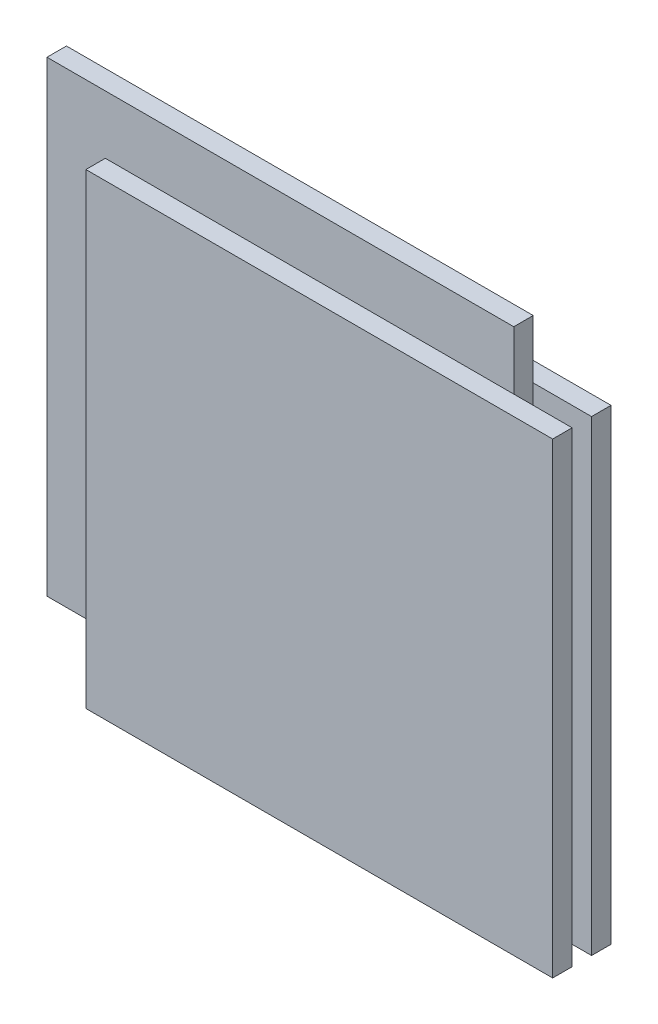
ISO-10303-21;
HEADER;
FILE_DESCRIPTION(('STEP AP214'),'2;1');
FILE_NAME('part.step','',(''),(''),'','','');
FILE_SCHEMA(('AUTOMOTIVE_DESIGN { 1 0 10303 214 1 1 1 1 }'));
ENDSEC;
DATA;
#1=APPLICATION_CONTEXT('core data for automotive mechanical design processes');
#2=APPLICATION_PROTOCOL_DEFINITION('international standard','automotive_design',2000,#1);
#3=PRODUCT_CONTEXT('',#1,'mechanical');
#4=PRODUCT('Part','Part','',(#3));
#5=PRODUCT_RELATED_PRODUCT_CATEGORY('part','',(#4));
#6=PRODUCT_DEFINITION_FORMATION('','',#4);
#7=PRODUCT_DEFINITION_CONTEXT('part definition',#1,'design');
#8=PRODUCT_DEFINITION('design','',#6,#7);
#9=PRODUCT_DEFINITION_SHAPE('','',#8);
#10=(LENGTH_UNIT() NAMED_UNIT(*) SI_UNIT(.MILLI.,.METRE.));
#11=(NAMED_UNIT(*) PLANE_ANGLE_UNIT() SI_UNIT($,.RADIAN.));
#12=(NAMED_UNIT(*) SI_UNIT($,.STERADIAN.) SOLID_ANGLE_UNIT());
#13=UNCERTAINTY_MEASURE_WITH_UNIT(LENGTH_MEASURE(1.E-05),#10,'distance_accuracy_value','');
#14=(GEOMETRIC_REPRESENTATION_CONTEXT(3) GLOBAL_UNCERTAINTY_ASSIGNED_CONTEXT((#13)) GLOBAL_UNIT_ASSIGNED_CONTEXT((#10,
#11,#12)) REPRESENTATION_CONTEXT('',''));
#15=CARTESIAN_POINT('',(0.,0.,0.));
#16=DIRECTION('',(0.,0.,1.));
#17=DIRECTION('',(1.,0.,0.));
#18=AXIS2_PLACEMENT_3D('',#15,#16,#17);
#19=CARTESIAN_POINT('',(0.,0.,-2.5));
#20=DIRECTION('',(0.,0.,1.));
#21=DIRECTION('',(1.,0.,0.));
#22=AXIS2_PLACEMENT_3D('',#19,#20,#21);
#23=PLANE('',#22);
#24=DIRECTION('',(1.,0.,0.));
#25=VECTOR('',#24,1.);
#26=CARTESIAN_POINT('',(75.,45.,-2.5));
#27=LINE('',#26,#25);
#28=CARTESIAN_POINT('',(-45.,45.,-2.5));
#29=VERTEX_POINT('',#28);
#30=CARTESIAN_POINT('',(60.,45.,-2.5));
#31=VERTEX_POINT('',#30);
#32=EDGE_CURVE('E467',#29,#31,#27,.T.);
#33=ORIENTED_EDGE('',*,*,#32,.F.);
#34=DIRECTION('',(0.,1.,0.));
#35=VECTOR('',#34,1.);
#36=CARTESIAN_POINT('',(-45.,45.,-2.5));
#37=LINE('',#36,#35);
#38=CARTESIAN_POINT('',(-45.,-60.,-2.5));
#39=VERTEX_POINT('',#38);
#40=EDGE_CURVE('E11',#39,#29,#37,.T.);
#41=ORIENTED_EDGE('',*,*,#40,.F.);
#42=DIRECTION('',(1.,0.,0.));
#43=VECTOR('',#42,1.);
#44=CARTESIAN_POINT('',(-60.,-60.,-2.5));
#45=LINE('',#44,#43);
#46=CARTESIAN_POINT('',(-60.,-60.,-2.5));
#47=VERTEX_POINT('',#46);
#48=EDGE_CURVE('E249',#47,#39,#45,.T.);
#49=ORIENTED_EDGE('',*,*,#48,.F.);
#50=DIRECTION('',(0.,-1.,0.));
#51=VECTOR('',#50,1.);
#52=CARTESIAN_POINT('',(-60.,60.,-2.5));
#53=LINE('',#52,#51);
#54=CARTESIAN_POINT('',(-60.,60.,-2.5));
#55=VERTEX_POINT('',#54);
#56=EDGE_CURVE('E245',#55,#47,#53,.T.);
#57=ORIENTED_EDGE('',*,*,#56,.F.);
#58=DIRECTION('',(-1.,0.,0.));
#59=VECTOR('',#58,1.);
#60=CARTESIAN_POINT('',(-60.,60.,-2.5));
#61=LINE('',#60,#59);
#62=CARTESIAN_POINT('',(60.,60.,-2.5));
#63=VERTEX_POINT('',#62);
#64=EDGE_CURVE('E242',#63,#55,#61,.T.);
#65=ORIENTED_EDGE('',*,*,#64,.F.);
#66=DIRECTION('',(0.,1.,0.));
#67=VECTOR('',#66,1.);
#68=CARTESIAN_POINT('',(60.,60.,-2.5));
#69=LINE('',#68,#67);
#70=EDGE_CURVE('E62',#31,#63,#69,.T.);
#71=ORIENTED_EDGE('',*,*,#70,.F.);
#72=EDGE_LOOP('',(#33,#41,#49,#57,#65,#71));
#73=FACE_BOUND('',#72,.T.);
#74=ADVANCED_FACE('F39',(#73),#23,.F.);
#75=CARTESIAN_POINT('',(60.,60.,2.5));
#76=DIRECTION('',(-1.,0.,0.));
#77=DIRECTION('',(0.,-1.,0.));
#78=AXIS2_PLACEMENT_3D('',#75,#76,#77);
#79=PLANE('',#78);
#80=CARTESIAN_POINT('',(60.,-60.,-2.5));
#81=VERTEX_POINT('',#80);
#82=EDGE_CURVE('E239',#81,#31,#69,.T.);
#83=ORIENTED_EDGE('',*,*,#82,.T.);
#84=ORIENTED_EDGE('',*,*,#70,.T.);
#85=DIRECTION('',(0.,0.,-1.));
#86=VECTOR('',#85,1.);
#87=CARTESIAN_POINT('',(60.,60.,2.5));
#88=LINE('',#87,#86);
#89=CARTESIAN_POINT('',(60.,60.,2.5));
#90=VERTEX_POINT('',#89);
#91=EDGE_CURVE('E43',#90,#63,#88,.T.);
#92=ORIENTED_EDGE('',*,*,#91,.F.);
#93=DIRECTION('',(0.,1.,0.));
#94=VECTOR('',#93,1.);
#95=CARTESIAN_POINT('',(60.,60.,2.5));
#96=LINE('',#95,#94);
#97=CARTESIAN_POINT('',(60.,45.,2.5));
#98=VERTEX_POINT('',#97);
#99=EDGE_CURVE('E227',#98,#90,#96,.T.);
#100=ORIENTED_EDGE('',*,*,#99,.F.);
#101=CARTESIAN_POINT('',(60.,-60.,2.5));
#102=VERTEX_POINT('',#101);
#103=EDGE_CURVE('E222',#102,#98,#96,.T.);
#104=ORIENTED_EDGE('',*,*,#103,.F.);
#105=DIRECTION('',(0.,0.,-1.));
#106=VECTOR('',#105,1.);
#107=CARTESIAN_POINT('',(60.,-60.,2.5));
#108=LINE('',#107,#106);
#109=EDGE_CURVE('E238',#102,#81,#108,.T.);
#110=ORIENTED_EDGE('',*,*,#109,.T.);
#111=EDGE_LOOP('',(#83,#84,#92,#100,#104,#110));
#112=FACE_BOUND('',#111,.T.);
#113=ADVANCED_FACE('F41',(#112),#79,.F.);
#114=CARTESIAN_POINT('',(-60.,60.,2.5));
#115=DIRECTION('',(0.,-1.,0.));
#116=DIRECTION('',(0.,0.,-1.));
#117=AXIS2_PLACEMENT_3D('',#114,#115,#116);
#118=PLANE('',#117);
#119=ORIENTED_EDGE('',*,*,#64,.T.);
#120=DIRECTION('',(0.,0.,-1.));
#121=VECTOR('',#120,1.);
#122=CARTESIAN_POINT('',(-60.,60.,2.5));
#123=LINE('',#122,#121);
#124=CARTESIAN_POINT('',(-60.,60.,2.5));
#125=VERTEX_POINT('',#124);
#126=EDGE_CURVE('E258',#125,#55,#123,.T.);
#127=ORIENTED_EDGE('',*,*,#126,.F.);
#128=DIRECTION('',(-1.,0.,0.));
#129=VECTOR('',#128,1.);
#130=CARTESIAN_POINT('',(-60.,60.,2.5));
#131=LINE('',#130,#129);
#132=EDGE_CURVE('E226',#90,#125,#131,.T.);
#133=ORIENTED_EDGE('',*,*,#132,.F.);
#134=ORIENTED_EDGE('',*,*,#91,.T.);
#135=EDGE_LOOP('',(#119,#127,#133,#134));
#136=FACE_BOUND('',#135,.T.);
#137=ADVANCED_FACE('F319',(#136),#118,.F.);
#138=CARTESIAN_POINT('',(-60.,60.,2.5));
#139=DIRECTION('',(1.,0.,0.));
#140=DIRECTION('',(0.,1.,0.));
#141=AXIS2_PLACEMENT_3D('',#138,#139,#140);
#142=PLANE('',#141);
#143=ORIENTED_EDGE('',*,*,#56,.T.);
#144=DIRECTION('',(0.,0.,-1.));
#145=VECTOR('',#144,1.);
#146=CARTESIAN_POINT('',(-60.,-60.,2.5));
#147=LINE('',#146,#145);
#148=CARTESIAN_POINT('',(-60.,-60.,2.5));
#149=VERTEX_POINT('',#148);
#150=EDGE_CURVE('E255',#149,#47,#147,.T.);
#151=ORIENTED_EDGE('',*,*,#150,.F.);
#152=DIRECTION('',(0.,-1.,0.));
#153=VECTOR('',#152,1.);
#154=CARTESIAN_POINT('',(-60.,60.,2.5));
#155=LINE('',#154,#153);
#156=EDGE_CURVE('E230',#125,#149,#155,.T.);
#157=ORIENTED_EDGE('',*,*,#156,.F.);
#158=ORIENTED_EDGE('',*,*,#126,.T.);
#159=EDGE_LOOP('',(#143,#151,#157,#158));
#160=FACE_BOUND('',#159,.T.);
#161=ADVANCED_FACE('F327',(#160),#142,.F.);
#162=CARTESIAN_POINT('',(-60.,-60.,2.5));
#163=DIRECTION('',(0.,1.,0.));
#164=DIRECTION('',(0.,0.,1.));
#165=AXIS2_PLACEMENT_3D('',#162,#163,#164);
#166=PLANE('',#165);
#167=ORIENTED_EDGE('',*,*,#48,.T.);
#168=EDGE_CURVE('E248',#39,#81,#45,.T.);
#169=ORIENTED_EDGE('',*,*,#168,.T.);
#170=ORIENTED_EDGE('',*,*,#109,.F.);
#171=DIRECTION('',(1.,0.,0.));
#172=VECTOR('',#171,1.);
#173=CARTESIAN_POINT('',(-60.,-60.,2.5));
#174=LINE('',#173,#172);
#175=CARTESIAN_POINT('',(-45.,-60.,2.5));
#176=VERTEX_POINT('',#175);
#177=EDGE_CURVE('E233',#176,#102,#174,.T.);
#178=ORIENTED_EDGE('',*,*,#177,.F.);
#179=EDGE_CURVE('E234',#149,#176,#174,.T.);
#180=ORIENTED_EDGE('',*,*,#179,.F.);
#181=ORIENTED_EDGE('',*,*,#150,.T.);
#182=EDGE_LOOP('',(#167,#169,#170,#178,#180,#181));
#183=FACE_BOUND('',#182,.T.);
#184=ADVANCED_FACE('F324',(#183),#166,.F.);
#185=CARTESIAN_POINT('',(0.,0.,2.5));
#186=DIRECTION('',(0.,0.,1.));
#187=DIRECTION('',(1.,0.,0.));
#188=AXIS2_PLACEMENT_3D('',#185,#186,#187);
#189=PLANE('',#188);
#190=DIRECTION('',(0.,-1.,0.));
#191=VECTOR('',#190,1.);
#192=CARTESIAN_POINT('',(-45.,45.,2.5));
#193=LINE('',#192,#191);
#194=CARTESIAN_POINT('',(-45.,45.,2.5));
#195=VERTEX_POINT('',#194);
#196=EDGE_CURVE('E201',#195,#176,#193,.T.);
#197=ORIENTED_EDGE('',*,*,#196,.F.);
#198=DIRECTION('',(-1.,0.,0.));
#199=VECTOR('',#198,1.);
#200=CARTESIAN_POINT('',(75.,45.,2.5));
#201=LINE('',#200,#199);
#202=EDGE_CURVE('E49',#98,#195,#201,.T.);
#203=ORIENTED_EDGE('',*,*,#202,.F.);
#204=ORIENTED_EDGE('',*,*,#99,.T.);
#205=ORIENTED_EDGE('',*,*,#132,.T.);
#206=ORIENTED_EDGE('',*,*,#156,.T.);
#207=ORIENTED_EDGE('',*,*,#179,.T.);
#208=EDGE_LOOP('',(#197,#203,#204,#205,#206,#207));
#209=FACE_BOUND('',#208,.T.);
#210=ADVANCED_FACE('F322',(#209),#189,.T.);
#211=CARTESIAN_POINT('',(0.,0.,2.5));
#212=DIRECTION('',(0.,0.,1.));
#213=DIRECTION('',(1.,0.,0.));
#214=AXIS2_PLACEMENT_3D('',#211,#212,#213);
#215=PLANE('',#214);
#216=ORIENTED_EDGE('',*,*,#177,.T.);
#217=ORIENTED_EDGE('',*,*,#103,.T.);
#218=CARTESIAN_POINT('',(75.,45.,2.5));
#219=VERTEX_POINT('',#218);
#220=EDGE_CURVE('E176',#219,#98,#201,.T.);
#221=ORIENTED_EDGE('',*,*,#220,.F.);
#222=DIRECTION('',(0.,1.,0.));
#223=VECTOR('',#222,1.);
#224=CARTESIAN_POINT('',(75.,-75.,2.5));
#225=LINE('',#224,#223);
#226=CARTESIAN_POINT('',(75.,-75.,2.5));
#227=VERTEX_POINT('',#226);
#228=EDGE_CURVE('E171',#227,#219,#225,.T.);
#229=ORIENTED_EDGE('',*,*,#228,.F.);
#230=DIRECTION('',(1.,0.,0.));
#231=VECTOR('',#230,1.);
#232=CARTESIAN_POINT('',(-45.,-75.,2.5));
#233=LINE('',#232,#231);
#234=CARTESIAN_POINT('',(-45.,-75.,2.5));
#235=VERTEX_POINT('',#234);
#236=EDGE_CURVE('E187',#235,#227,#233,.T.);
#237=ORIENTED_EDGE('',*,*,#236,.F.);
#238=EDGE_CURVE('E200',#176,#235,#193,.T.);
#239=ORIENTED_EDGE('',*,*,#238,.F.);
#240=EDGE_LOOP('',(#216,#217,#221,#229,#237,#239));
#241=FACE_BOUND('',#240,.T.);
#242=ADVANCED_FACE('F293',(#241),#215,.F.);
#243=CARTESIAN_POINT('',(75.,-75.,7.5));
#244=DIRECTION('',(-1.,0.,0.));
#245=DIRECTION('',(0.,0.,1.));
#246=AXIS2_PLACEMENT_3D('',#243,#244,#245);
#247=PLANE('',#246);
#248=ORIENTED_EDGE('',*,*,#228,.T.);
#249=DIRECTION('',(0.,0.,-1.));
#250=VECTOR('',#249,1.);
#251=CARTESIAN_POINT('',(75.,45.,7.5));
#252=LINE('',#251,#250);
#253=CARTESIAN_POINT('',(75.,45.,7.5));
#254=VERTEX_POINT('',#253);
#255=EDGE_CURVE('E218',#254,#219,#252,.T.);
#256=ORIENTED_EDGE('',*,*,#255,.F.);
#257=DIRECTION('',(0.,1.,0.));
#258=VECTOR('',#257,1.);
#259=CARTESIAN_POINT('',(75.,-75.,7.5));
#260=LINE('',#259,#258);
#261=CARTESIAN_POINT('',(75.,-75.,7.5));
#262=VERTEX_POINT('',#261);
#263=EDGE_CURVE('E182',#262,#254,#260,.T.);
#264=ORIENTED_EDGE('',*,*,#263,.F.);
#265=DIRECTION('',(0.,0.,-1.));
#266=VECTOR('',#265,1.);
#267=CARTESIAN_POINT('',(75.,-75.,7.5));
#268=LINE('',#267,#266);
#269=EDGE_CURVE('E195',#262,#227,#268,.T.);
#270=ORIENTED_EDGE('',*,*,#269,.T.);
#271=EDGE_LOOP('',(#248,#256,#264,#270));
#272=FACE_BOUND('',#271,.T.);
#273=ADVANCED_FACE('F289',(#272),#247,.F.);
#274=CARTESIAN_POINT('',(75.,45.,7.5));
#275=DIRECTION('',(0.,-1.,0.));
#276=DIRECTION('',(0.,0.,-1.));
#277=AXIS2_PLACEMENT_3D('',#274,#275,#276);
#278=PLANE('',#277);
#279=ORIENTED_EDGE('',*,*,#220,.T.);
#280=ORIENTED_EDGE('',*,*,#202,.T.);
#281=DIRECTION('',(0.,0.,-1.));
#282=VECTOR('',#281,1.);
#283=CARTESIAN_POINT('',(-45.,45.,7.5));
#284=LINE('',#283,#282);
#285=CARTESIAN_POINT('',(-45.,45.,7.5));
#286=VERTEX_POINT('',#285);
#287=EDGE_CURVE('E214',#286,#195,#284,.T.);
#288=ORIENTED_EDGE('',*,*,#287,.F.);
#289=DIRECTION('',(-1.,0.,0.));
#290=VECTOR('',#289,1.);
#291=CARTESIAN_POINT('',(75.,45.,7.5));
#292=LINE('',#291,#290);
#293=EDGE_CURVE('E186',#254,#286,#292,.T.);
#294=ORIENTED_EDGE('',*,*,#293,.F.);
#295=ORIENTED_EDGE('',*,*,#255,.T.);
#296=EDGE_LOOP('',(#279,#280,#288,#294,#295));
#297=FACE_BOUND('',#296,.T.);
#298=ADVANCED_FACE('F274',(#297),#278,.F.);
#299=CARTESIAN_POINT('',(-45.,45.,7.5));
#300=DIRECTION('',(1.,0.,0.));
#301=DIRECTION('',(0.,1.,0.));
#302=AXIS2_PLACEMENT_3D('',#299,#300,#301);
#303=PLANE('',#302);
#304=ORIENTED_EDGE('',*,*,#196,.T.);
#305=ORIENTED_EDGE('',*,*,#238,.T.);
#306=DIRECTION('',(0.,0.,-1.));
#307=VECTOR('',#306,1.);
#308=CARTESIAN_POINT('',(-45.,-75.,7.5));
#309=LINE('',#308,#307);
#310=CARTESIAN_POINT('',(-45.,-75.,7.5));
#311=VERTEX_POINT('',#310);
#312=EDGE_CURVE('E210',#311,#235,#309,.T.);
#313=ORIENTED_EDGE('',*,*,#312,.F.);
#314=DIRECTION('',(0.,-1.,0.));
#315=VECTOR('',#314,1.);
#316=CARTESIAN_POINT('',(-45.,45.,7.5));
#317=LINE('',#316,#315);
#318=EDGE_CURVE('E190',#286,#311,#317,.T.);
#319=ORIENTED_EDGE('',*,*,#318,.F.);
#320=ORIENTED_EDGE('',*,*,#287,.T.);
#321=EDGE_LOOP('',(#304,#305,#313,#319,#320));
#322=FACE_BOUND('',#321,.T.);
#323=ADVANCED_FACE('F279',(#322),#303,.F.);
#324=CARTESIAN_POINT('',(-45.,-75.,7.5));
#325=DIRECTION('',(0.,1.,0.));
#326=DIRECTION('',(0.,0.,1.));
#327=AXIS2_PLACEMENT_3D('',#324,#325,#326);
#328=PLANE('',#327);
#329=ORIENTED_EDGE('',*,*,#236,.T.);
#330=ORIENTED_EDGE('',*,*,#269,.F.);
#331=DIRECTION('',(1.,0.,0.));
#332=VECTOR('',#331,1.);
#333=CARTESIAN_POINT('',(-45.,-75.,7.5));
#334=LINE('',#333,#332);
#335=EDGE_CURVE('E193',#311,#262,#334,.T.);
#336=ORIENTED_EDGE('',*,*,#335,.F.);
#337=ORIENTED_EDGE('',*,*,#312,.T.);
#338=EDGE_LOOP('',(#329,#330,#336,#337));
#339=FACE_BOUND('',#338,.T.);
#340=ADVANCED_FACE('F303',(#339),#328,.F.);
#341=CARTESIAN_POINT('',(0.,0.,7.5));
#342=DIRECTION('',(0.,0.,1.));
#343=DIRECTION('',(1.,0.,0.));
#344=AXIS2_PLACEMENT_3D('',#341,#342,#343);
#345=PLANE('',#344);
#346=ORIENTED_EDGE('',*,*,#263,.T.);
#347=ORIENTED_EDGE('',*,*,#293,.T.);
#348=ORIENTED_EDGE('',*,*,#318,.T.);
#349=ORIENTED_EDGE('',*,*,#335,.T.);
#350=EDGE_LOOP('',(#346,#347,#348,#349));
#351=FACE_BOUND('',#350,.T.);
#352=ADVANCED_FACE('F283',(#351),#345,.T.);
#353=CARTESIAN_POINT('',(0.,0.,-2.5));
#354=DIRECTION('',(0.,0.,1.));
#355=DIRECTION('',(1.,0.,0.));
#356=AXIS2_PLACEMENT_3D('',#353,#354,#355);
#357=PLANE('',#356);
#358=ORIENTED_EDGE('',*,*,#82,.F.);
#359=ORIENTED_EDGE('',*,*,#168,.F.);
#360=CARTESIAN_POINT('',(-45.,-75.,-2.5));
#361=VERTEX_POINT('',#360);
#362=EDGE_CURVE('E51',#361,#39,#37,.T.);
#363=ORIENTED_EDGE('',*,*,#362,.F.);
#364=DIRECTION('',(-1.,0.,0.));
#365=VECTOR('',#364,1.);
#366=CARTESIAN_POINT('',(-45.,-75.,-2.5));
#367=LINE('',#366,#365);
#368=CARTESIAN_POINT('',(75.,-75.,-2.5));
#369=VERTEX_POINT('',#368);
#370=EDGE_CURVE('E169',#369,#361,#367,.T.);
#371=ORIENTED_EDGE('',*,*,#370,.F.);
#372=DIRECTION('',(0.,-1.,0.));
#373=VECTOR('',#372,1.);
#374=CARTESIAN_POINT('',(75.,-75.,-2.5));
#375=LINE('',#374,#373);
#376=CARTESIAN_POINT('',(75.,45.,-2.5));
#377=VERTEX_POINT('',#376);
#378=EDGE_CURVE('E165',#377,#369,#375,.T.);
#379=ORIENTED_EDGE('',*,*,#378,.F.);
#380=EDGE_CURVE('E462',#31,#377,#27,.T.);
#381=ORIENTED_EDGE('',*,*,#380,.F.);
#382=EDGE_LOOP('',(#358,#359,#363,#371,#379,#381));
#383=FACE_BOUND('',#382,.T.);
#384=ADVANCED_FACE('F310',(#383),#357,.T.);
#385=CARTESIAN_POINT('',(-45.,-75.,-7.5));
#386=DIRECTION('',(0.,1.,0.));
#387=DIRECTION('',(0.,0.,1.));
#388=AXIS2_PLACEMENT_3D('',#385,#386,#387);
#389=PLANE('',#388);
#390=ORIENTED_EDGE('',*,*,#370,.T.);
#391=DIRECTION('',(0.,0.,1.));
#392=VECTOR('',#391,1.);
#393=CARTESIAN_POINT('',(-45.,-75.,-7.5));
#394=LINE('',#393,#392);
#395=CARTESIAN_POINT('',(-45.,-75.,-7.5));
#396=VERTEX_POINT('',#395);
#397=EDGE_CURVE('E147',#396,#361,#394,.T.);
#398=ORIENTED_EDGE('',*,*,#397,.F.);
#399=DIRECTION('',(-1.,0.,0.));
#400=VECTOR('',#399,1.);
#401=CARTESIAN_POINT('',(-45.,-75.,-7.5));
#402=LINE('',#401,#400);
#403=CARTESIAN_POINT('',(75.,-75.,-7.5));
#404=VERTEX_POINT('',#403);
#405=EDGE_CURVE('E155',#404,#396,#402,.T.);
#406=ORIENTED_EDGE('',*,*,#405,.F.);
#407=DIRECTION('',(0.,0.,1.));
#408=VECTOR('',#407,1.);
#409=CARTESIAN_POINT('',(75.,-75.,-7.5));
#410=LINE('',#409,#408);
#411=EDGE_CURVE('E474',#404,#369,#410,.T.);
#412=ORIENTED_EDGE('',*,*,#411,.T.);
#413=EDGE_LOOP('',(#390,#398,#406,#412));
#414=FACE_BOUND('',#413,.T.);
#415=ADVANCED_FACE('F167',(#414),#389,.F.);
#416=CARTESIAN_POINT('',(-45.,45.,-7.5));
#417=DIRECTION('',(1.,0.,0.));
#418=DIRECTION('',(0.,1.,0.));
#419=AXIS2_PLACEMENT_3D('',#416,#417,#418);
#420=PLANE('',#419);
#421=ORIENTED_EDGE('',*,*,#362,.T.);
#422=ORIENTED_EDGE('',*,*,#40,.T.);
#423=DIRECTION('',(0.,0.,1.));
#424=VECTOR('',#423,1.);
#425=CARTESIAN_POINT('',(-45.,45.,-7.5));
#426=LINE('',#425,#424);
#427=CARTESIAN_POINT('',(-45.,45.,-7.5));
#428=VERTEX_POINT('',#427);
#429=EDGE_CURVE('E150',#428,#29,#426,.T.);
#430=ORIENTED_EDGE('',*,*,#429,.F.);
#431=DIRECTION('',(0.,1.,0.));
#432=VECTOR('',#431,1.);
#433=CARTESIAN_POINT('',(-45.,45.,-7.5));
#434=LINE('',#433,#432);
#435=EDGE_CURVE('E142',#396,#428,#434,.T.);
#436=ORIENTED_EDGE('',*,*,#435,.F.);
#437=ORIENTED_EDGE('',*,*,#397,.T.);
#438=EDGE_LOOP('',(#421,#422,#430,#436,#437));
#439=FACE_BOUND('',#438,.T.);
#440=ADVANCED_FACE('F145',(#439),#420,.F.);
#441=CARTESIAN_POINT('',(75.,45.,-7.5));
#442=DIRECTION('',(0.,-1.,0.));
#443=DIRECTION('',(0.,0.,-1.));
#444=AXIS2_PLACEMENT_3D('',#441,#442,#443);
#445=PLANE('',#444);
#446=ORIENTED_EDGE('',*,*,#32,.T.);
#447=ORIENTED_EDGE('',*,*,#380,.T.);
#448=DIRECTION('',(0.,0.,1.));
#449=VECTOR('',#448,1.);
#450=CARTESIAN_POINT('',(75.,45.,-7.5));
#451=LINE('',#450,#449);
#452=CARTESIAN_POINT('',(75.,45.,-7.5));
#453=VERTEX_POINT('',#452);
#454=EDGE_CURVE('E178',#453,#377,#451,.T.);
#455=ORIENTED_EDGE('',*,*,#454,.F.);
#456=DIRECTION('',(1.,0.,0.));
#457=VECTOR('',#456,1.);
#458=CARTESIAN_POINT('',(75.,45.,-7.5));
#459=LINE('',#458,#457);
#460=EDGE_CURVE('E154',#428,#453,#459,.T.);
#461=ORIENTED_EDGE('',*,*,#460,.F.);
#462=ORIENTED_EDGE('',*,*,#429,.T.);
#463=EDGE_LOOP('',(#446,#447,#455,#461,#462));
#464=FACE_BOUND('',#463,.T.);
#465=ADVANCED_FACE('F348',(#464),#445,.F.);
#466=CARTESIAN_POINT('',(75.,-75.,-7.5));
#467=DIRECTION('',(-1.,0.,0.));
#468=DIRECTION('',(0.,0.,1.));
#469=AXIS2_PLACEMENT_3D('',#466,#467,#468);
#470=PLANE('',#469);
#471=ORIENTED_EDGE('',*,*,#378,.T.);
#472=ORIENTED_EDGE('',*,*,#411,.F.);
#473=DIRECTION('',(0.,-1.,0.));
#474=VECTOR('',#473,1.);
#475=CARTESIAN_POINT('',(75.,-75.,-7.5));
#476=LINE('',#475,#474);
#477=EDGE_CURVE('E160',#453,#404,#476,.T.);
#478=ORIENTED_EDGE('',*,*,#477,.F.);
#479=ORIENTED_EDGE('',*,*,#454,.T.);
#480=EDGE_LOOP('',(#471,#472,#478,#479));
#481=FACE_BOUND('',#480,.T.);
#482=ADVANCED_FACE('F351',(#481),#470,.F.);
#483=CARTESIAN_POINT('',(0.,0.,-7.5));
#484=DIRECTION('',(0.,0.,1.));
#485=DIRECTION('',(1.,0.,0.));
#486=AXIS2_PLACEMENT_3D('',#483,#484,#485);
#487=PLANE('',#486);
#488=ORIENTED_EDGE('',*,*,#405,.T.);
#489=ORIENTED_EDGE('',*,*,#435,.T.);
#490=ORIENTED_EDGE('',*,*,#460,.T.);
#491=ORIENTED_EDGE('',*,*,#477,.T.);
#492=EDGE_LOOP('',(#488,#489,#490,#491));
#493=FACE_BOUND('',#492,.T.);
#494=ADVANCED_FACE('F158',(#493),#487,.F.);
#495=CLOSED_SHELL('',(#74,#113,#137,#161,#184,#210,#242,#273,#298,#323,#340,#352,#384,#415,#440,
#465,#482,#494));
#496=MANIFOLD_SOLID_BREP('B2',#495);
#497=ADVANCED_BREP_SHAPE_REPRESENTATION('',(#18,#496),#14);
#498=SHAPE_DEFINITION_REPRESENTATION(#9,#497);
ENDSEC;
END-ISO-10303-21;
